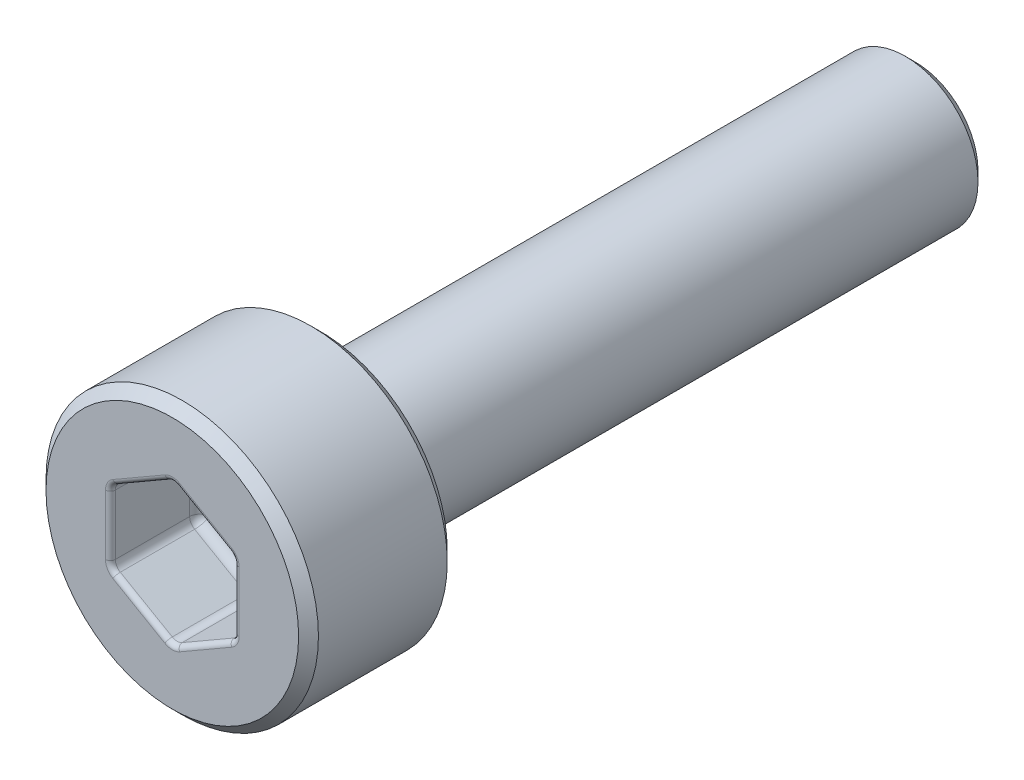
ISO-10303-21;
HEADER;
FILE_DESCRIPTION(('STEP AP214'),'2;1');
FILE_NAME('part.step','',(''),(''),'','','');
FILE_SCHEMA(('AUTOMOTIVE_DESIGN { 1 0 10303 214 1 1 1 1 }'));
ENDSEC;
DATA;
#1=APPLICATION_CONTEXT('core data for automotive mechanical design processes');
#2=APPLICATION_PROTOCOL_DEFINITION('international standard','automotive_design',2000,#1);
#3=PRODUCT_CONTEXT('',#1,'mechanical');
#4=PRODUCT('Part','Part','',(#3));
#5=PRODUCT_RELATED_PRODUCT_CATEGORY('part','',(#4));
#6=PRODUCT_DEFINITION_FORMATION('','',#4);
#7=PRODUCT_DEFINITION_CONTEXT('part definition',#1,'design');
#8=PRODUCT_DEFINITION('design','',#6,#7);
#9=PRODUCT_DEFINITION_SHAPE('','',#8);
#10=(LENGTH_UNIT() NAMED_UNIT(*) SI_UNIT(.MILLI.,.METRE.));
#11=(NAMED_UNIT(*) PLANE_ANGLE_UNIT() SI_UNIT($,.RADIAN.));
#12=(NAMED_UNIT(*) SI_UNIT($,.STERADIAN.) SOLID_ANGLE_UNIT());
#13=UNCERTAINTY_MEASURE_WITH_UNIT(LENGTH_MEASURE(1.E-05),#10,'distance_accuracy_value','');
#14=(GEOMETRIC_REPRESENTATION_CONTEXT(3) GLOBAL_UNCERTAINTY_ASSIGNED_CONTEXT((#13)) GLOBAL_UNIT_ASSIGNED_CONTEXT((#10,
#11,#12)) REPRESENTATION_CONTEXT('',''));
#15=CARTESIAN_POINT('',(0.,0.,0.));
#16=DIRECTION('',(0.,0.,1.));
#17=DIRECTION('',(1.,0.,0.));
#18=AXIS2_PLACEMENT_3D('',#15,#16,#17);
#19=CARTESIAN_POINT('',(0.,0.,3.));
#20=DIRECTION('',(0.,0.,-1.));
#21=DIRECTION('',(-1.,0.,0.));
#22=AXIS2_PLACEMENT_3D('',#19,#20,#21);
#23=PLANE('',#22);
#24=DIRECTION('',(0.,1.,0.));
#25=VECTOR('',#24,1.);
#26=CARTESIAN_POINT('',(1.35,0.,3.));
#27=LINE('',#26,#25);
#28=CARTESIAN_POINT('',(1.35,0.606217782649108,3.));
#29=VERTEX_POINT('',#28);
#30=CARTESIAN_POINT('',(1.35,-0.606217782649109,3.));
#31=VERTEX_POINT('',#30);
#32=EDGE_CURVE('E266',#29,#31,#27,.F.);
#33=ORIENTED_EDGE('',*,*,#32,.T.);
#34=CARTESIAN_POINT('',(1.05,-0.606217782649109,3.));
#35=DIRECTION('',(0.,0.,-1.));
#36=DIRECTION('',(-1.,0.,0.));
#37=AXIS2_PLACEMENT_3D('',#34,#35,#36);
#38=CIRCLE('',#37,0.3);
#39=CARTESIAN_POINT('',(1.2,-0.866025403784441,3.));
#40=VERTEX_POINT('',#39);
#41=EDGE_CURVE('E331',#31,#40,#38,.T.);
#42=ORIENTED_EDGE('',*,*,#41,.T.);
#43=DIRECTION('',(0.866025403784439,0.499999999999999,0.));
#44=VECTOR('',#43,1.);
#45=CARTESIAN_POINT('',(0.675,-1.16913429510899,3.));
#46=LINE('',#45,#44);
#47=CARTESIAN_POINT('',(0.15,-1.47224318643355,3.));
#48=VERTEX_POINT('',#47);
#49=EDGE_CURVE('E329',#40,#48,#46,.F.);
#50=ORIENTED_EDGE('',*,*,#49,.T.);
#51=CARTESIAN_POINT('',(0.,-1.21243556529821,3.));
#52=DIRECTION('',(0.,0.,-1.));
#53=DIRECTION('',(-1.,0.,0.));
#54=AXIS2_PLACEMENT_3D('',#51,#52,#53);
#55=CIRCLE('',#54,0.3);
#56=CARTESIAN_POINT('',(-0.15,-1.47224318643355,3.));
#57=VERTEX_POINT('',#56);
#58=EDGE_CURVE('E327',#48,#57,#55,.T.);
#59=ORIENTED_EDGE('',*,*,#58,.T.);
#60=DIRECTION('',(0.866025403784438,-0.500000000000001,0.));
#61=VECTOR('',#60,1.);
#62=CARTESIAN_POINT('',(-0.675000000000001,-1.16913429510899,3.));
#63=LINE('',#62,#61);
#64=CARTESIAN_POINT('',(-1.2,-0.866025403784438,3.));
#65=VERTEX_POINT('',#64);
#66=EDGE_CURVE('E325',#57,#65,#63,.F.);
#67=ORIENTED_EDGE('',*,*,#66,.T.);
#68=CARTESIAN_POINT('',(-1.05,-0.606217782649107,3.));
#69=DIRECTION('',(0.,0.,-1.));
#70=DIRECTION('',(-1.,0.,0.));
#71=AXIS2_PLACEMENT_3D('',#68,#69,#70);
#72=CIRCLE('',#71,0.3);
#73=CARTESIAN_POINT('',(-1.35,-0.606217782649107,3.));
#74=VERTEX_POINT('',#73);
#75=EDGE_CURVE('E323',#65,#74,#72,.T.);
#76=ORIENTED_EDGE('',*,*,#75,.T.);
#77=DIRECTION('',(0.,-1.,0.));
#78=VECTOR('',#77,1.);
#79=CARTESIAN_POINT('',(-1.35,0.,3.));
#80=LINE('',#79,#78);
#81=CARTESIAN_POINT('',(-1.35,0.606217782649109,3.));
#82=VERTEX_POINT('',#81);
#83=EDGE_CURVE('E321',#74,#82,#80,.F.);
#84=ORIENTED_EDGE('',*,*,#83,.T.);
#85=CARTESIAN_POINT('',(-1.05,0.606217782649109,3.));
#86=DIRECTION('',(0.,0.,-1.));
#87=DIRECTION('',(-1.,0.,0.));
#88=AXIS2_PLACEMENT_3D('',#85,#86,#87);
#89=CIRCLE('',#88,0.3);
#90=CARTESIAN_POINT('',(-1.2,0.86602540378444,3.));
#91=VERTEX_POINT('',#90);
#92=EDGE_CURVE('E319',#82,#91,#89,.T.);
#93=ORIENTED_EDGE('',*,*,#92,.T.);
#94=DIRECTION('',(-0.866025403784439,-0.5,0.));
#95=VECTOR('',#94,1.);
#96=CARTESIAN_POINT('',(-0.675,1.16913429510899,3.));
#97=LINE('',#96,#95);
#98=CARTESIAN_POINT('',(-0.149999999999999,1.47224318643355,3.));
#99=VERTEX_POINT('',#98);
#100=EDGE_CURVE('E317',#91,#99,#97,.F.);
#101=ORIENTED_EDGE('',*,*,#100,.T.);
#102=CARTESIAN_POINT('',(0.,1.21243556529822,3.));
#103=DIRECTION('',(0.,0.,-1.));
#104=DIRECTION('',(-1.,0.,0.));
#105=AXIS2_PLACEMENT_3D('',#102,#103,#104);
#106=CIRCLE('',#105,0.3);
#107=CARTESIAN_POINT('',(0.150000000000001,1.47224318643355,3.));
#108=VERTEX_POINT('',#107);
#109=EDGE_CURVE('E315',#99,#108,#106,.T.);
#110=ORIENTED_EDGE('',*,*,#109,.T.);
#111=DIRECTION('',(-0.866025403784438,0.5,0.));
#112=VECTOR('',#111,1.);
#113=CARTESIAN_POINT('',(0.675000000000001,1.16913429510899,3.));
#114=LINE('',#113,#112);
#115=CARTESIAN_POINT('',(1.2,0.86602540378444,3.));
#116=VERTEX_POINT('',#115);
#117=EDGE_CURVE('E313',#108,#116,#114,.F.);
#118=ORIENTED_EDGE('',*,*,#117,.T.);
#119=CARTESIAN_POINT('',(1.05,0.606217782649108,3.));
#120=DIRECTION('',(0.,0.,-1.));
#121=DIRECTION('',(-1.,0.,0.));
#122=AXIS2_PLACEMENT_3D('',#119,#120,#121);
#123=CIRCLE('',#122,0.3);
#124=EDGE_CURVE('E311',#116,#29,#123,.T.);
#125=ORIENTED_EDGE('',*,*,#124,.T.);
#126=EDGE_LOOP('',(#33,#42,#50,#59,#67,#76,#84,#93,#101,#110,#118,#125));
#127=FACE_BOUND('',#126,.T.);
#128=CARTESIAN_POINT('',(0.,0.,3.));
#129=DIRECTION('',(0.,0.,-1.));
#130=DIRECTION('',(-1.,0.,0.));
#131=AXIS2_PLACEMENT_3D('',#128,#129,#130);
#132=CIRCLE('',#131,2.55);
#133=CARTESIAN_POINT('',(-2.55,0.,3.));
#134=VERTEX_POINT('',#133);
#135=EDGE_CURVE('E309',#134,#134,#132,.F.);
#136=ORIENTED_EDGE('',*,*,#135,.T.);
#137=EDGE_LOOP('',(#136));
#138=FACE_BOUND('',#137,.T.);
#139=ADVANCED_FACE('F37',(#127,#138),#23,.F.);
#140=CARTESIAN_POINT('',(0.,0.,21.9198795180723));
#141=DIRECTION('',(0.,0.,1.));
#142=DIRECTION('',(1.,0.,0.));
#143=AXIS2_PLACEMENT_3D('',#140,#141,#142);
#144=CYLINDRICAL_SURFACE('',#143,2.75);
#145=CARTESIAN_POINT('',(0.,0.,2.79999999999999));
#146=DIRECTION('',(0.,0.,-1.));
#147=DIRECTION('',(-1.,0.,0.));
#148=AXIS2_PLACEMENT_3D('',#145,#146,#147);
#149=CIRCLE('',#148,2.75);
#150=CARTESIAN_POINT('',(-2.75,0.,2.79999999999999));
#151=VERTEX_POINT('',#150);
#152=EDGE_CURVE('E871',#151,#151,#149,.T.);
#153=ORIENTED_EDGE('',*,*,#152,.T.);
#154=EDGE_LOOP('',(#153));
#155=FACE_BOUND('',#154,.T.);
#156=CARTESIAN_POINT('',(0.,0.,0.200000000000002));
#157=DIRECTION('',(0.,0.,1.));
#158=DIRECTION('',(1.,0.,0.));
#159=AXIS2_PLACEMENT_3D('',#156,#157,#158);
#160=CIRCLE('',#159,2.75);
#161=CARTESIAN_POINT('',(2.75,0.,0.200000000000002));
#162=VERTEX_POINT('',#161);
#163=EDGE_CURVE('E876',#162,#162,#160,.T.);
#164=ORIENTED_EDGE('',*,*,#163,.T.);
#165=EDGE_LOOP('',(#164));
#166=FACE_BOUND('',#165,.T.);
#167=ADVANCED_FACE('F430',(#155,#166),#144,.T.);
#168=CARTESIAN_POINT('',(0.,2.75,0.));
#169=DIRECTION('',(0.,0.,1.));
#170=DIRECTION('',(1.,0.,0.));
#171=AXIS2_PLACEMENT_3D('',#168,#169,#170);
#172=PLANE('',#171);
#173=CARTESIAN_POINT('',(0.,0.,0.));
#174=DIRECTION('',(0.,0.,1.));
#175=DIRECTION('',(1.,0.,0.));
#176=AXIS2_PLACEMENT_3D('',#173,#174,#175);
#177=CIRCLE('',#176,1.665);
#178=CARTESIAN_POINT('',(1.665,0.,0.));
#179=VERTEX_POINT('',#178);
#180=EDGE_CURVE('E261',#179,#179,#177,.T.);
#181=ORIENTED_EDGE('',*,*,#180,.T.);
#182=EDGE_LOOP('',(#181));
#183=FACE_BOUND('',#182,.T.);
#184=CARTESIAN_POINT('',(0.,0.,0.));
#185=DIRECTION('',(0.,0.,1.));
#186=DIRECTION('',(1.,0.,0.));
#187=AXIS2_PLACEMENT_3D('',#184,#185,#186);
#188=CIRCLE('',#187,2.54999999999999);
#189=CARTESIAN_POINT('',(2.54999999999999,0.,0.));
#190=VERTEX_POINT('',#189);
#191=EDGE_CURVE('E869',#190,#190,#188,.F.);
#192=ORIENTED_EDGE('',*,*,#191,.T.);
#193=EDGE_LOOP('',(#192));
#194=FACE_BOUND('',#193,.T.);
#195=ADVANCED_FACE('F436',(#183,#194),#172,.F.);
#196=CARTESIAN_POINT('',(0.,0.,21.9198795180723));
#197=DIRECTION('',(0.,0.,1.));
#198=DIRECTION('',(1.,0.,0.));
#199=AXIS2_PLACEMENT_3D('',#196,#197,#198);
#200=CYLINDRICAL_SURFACE('',#199,1.465);
#201=CARTESIAN_POINT('',(0.,0.,-0.200000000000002));
#202=DIRECTION('',(0.,0.,1.));
#203=DIRECTION('',(1.,0.,0.));
#204=AXIS2_PLACEMENT_3D('',#201,#202,#203);
#205=CIRCLE('',#204,1.465);
#206=CARTESIAN_POINT('',(1.465,0.,-0.200000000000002));
#207=VERTEX_POINT('',#206);
#208=EDGE_CURVE('E264',#207,#207,#205,.F.);
#209=ORIENTED_EDGE('',*,*,#208,.T.);
#210=EDGE_LOOP('',(#209));
#211=FACE_BOUND('',#210,.T.);
#212=CARTESIAN_POINT('',(0.,0.,-11.8));
#213=DIRECTION('',(0.,0.,1.));
#214=DIRECTION('',(1.,0.,0.));
#215=AXIS2_PLACEMENT_3D('',#212,#213,#214);
#216=CIRCLE('',#215,1.465);
#217=CARTESIAN_POINT('',(1.465,0.,-11.8));
#218=VERTEX_POINT('',#217);
#219=EDGE_CURVE('E870',#218,#218,#216,.T.);
#220=ORIENTED_EDGE('',*,*,#219,.T.);
#221=EDGE_LOOP('',(#220));
#222=FACE_BOUND('',#221,.T.);
#223=ADVANCED_FACE('F811',(#211,#222),#200,.T.);
#224=CARTESIAN_POINT('',(0.,1.465,-12.));
#225=DIRECTION('',(0.,0.,1.));
#226=DIRECTION('',(1.,0.,0.));
#227=AXIS2_PLACEMENT_3D('',#224,#225,#226);
#228=PLANE('',#227);
#229=CARTESIAN_POINT('',(0.,0.,-12.));
#230=DIRECTION('',(0.,0.,1.));
#231=DIRECTION('',(1.,0.,0.));
#232=AXIS2_PLACEMENT_3D('',#229,#230,#231);
#233=CIRCLE('',#232,1.265);
#234=CARTESIAN_POINT('',(1.265,0.,-12.));
#235=VERTEX_POINT('',#234);
#236=EDGE_CURVE('E211',#235,#235,#233,.F.);
#237=ORIENTED_EDGE('',*,*,#236,.T.);
#238=EDGE_LOOP('',(#237));
#239=FACE_BOUND('',#238,.T.);
#240=ADVANCED_FACE('F803',(#239),#228,.F.);
#241=CARTESIAN_POINT('',(0.,-1.44337567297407,1.2));
#242=DIRECTION('',(0.499999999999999,-0.866025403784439,0.));
#243=DIRECTION('',(0.866025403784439,0.499999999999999,0.));
#244=AXIS2_PLACEMENT_3D('',#241,#242,#243);
#245=PLANE('',#244);
#246=DIRECTION('',(0.,0.,1.));
#247=VECTOR('',#246,1.);
#248=CARTESIAN_POINT('',(0.0999999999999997,-1.3856406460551,3.));
#249=LINE('',#248,#247);
#250=CARTESIAN_POINT('',(0.0999999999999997,-1.3856406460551,1.4));
#251=VERTEX_POINT('',#250);
#252=CARTESIAN_POINT('',(0.0999999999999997,-1.3856406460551,2.9));
#253=VERTEX_POINT('',#252);
#254=EDGE_CURVE('E258',#251,#253,#249,.T.);
#255=ORIENTED_EDGE('',*,*,#254,.T.);
#256=DIRECTION('',(0.866025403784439,0.499999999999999,0.));
#257=VECTOR('',#256,1.);
#258=CARTESIAN_POINT('',(0.,-1.44337567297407,2.9));
#259=LINE('',#258,#257);
#260=CARTESIAN_POINT('',(1.15,-0.779422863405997,2.9));
#261=VERTEX_POINT('',#260);
#262=EDGE_CURVE('E337',#253,#261,#259,.T.);
#263=ORIENTED_EDGE('',*,*,#262,.T.);
#264=DIRECTION('',(0.,0.,1.));
#265=VECTOR('',#264,1.);
#266=CARTESIAN_POINT('',(1.15,-0.779422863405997,1.2));
#267=LINE('',#266,#265);
#268=CARTESIAN_POINT('',(1.15,-0.779422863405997,1.4));
#269=VERTEX_POINT('',#268);
#270=EDGE_CURVE('E254',#261,#269,#267,.F.);
#271=ORIENTED_EDGE('',*,*,#270,.T.);
#272=DIRECTION('',(0.866025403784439,0.499999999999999,0.));
#273=VECTOR('',#272,1.);
#274=CARTESIAN_POINT('',(0.,-1.44337567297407,1.4));
#275=LINE('',#274,#273);
#276=EDGE_CURVE('E256',#269,#251,#275,.F.);
#277=ORIENTED_EDGE('',*,*,#276,.T.);
#278=EDGE_LOOP('',(#255,#263,#271,#277));
#279=FACE_BOUND('',#278,.T.);
#280=ADVANCED_FACE('F794',(#279),#245,.F.);
#281=CARTESIAN_POINT('',(-1.25,-0.721687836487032,1.2));
#282=DIRECTION('',(-0.5,-0.866025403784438,0.));
#283=DIRECTION('',(0.866025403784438,-0.500000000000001,0.));
#284=AXIS2_PLACEMENT_3D('',#281,#282,#283);
#285=PLANE('',#284);
#286=DIRECTION('',(0.,0.,1.));
#287=VECTOR('',#286,1.);
#288=CARTESIAN_POINT('',(-1.15,-0.779422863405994,3.));
#289=LINE('',#288,#287);
#290=CARTESIAN_POINT('',(-1.15,-0.779422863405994,1.4));
#291=VERTEX_POINT('',#290);
#292=CARTESIAN_POINT('',(-1.15,-0.779422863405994,2.9));
#293=VERTEX_POINT('',#292);
#294=EDGE_CURVE('E225',#291,#293,#289,.T.);
#295=ORIENTED_EDGE('',*,*,#294,.T.);
#296=DIRECTION('',(0.866025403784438,-0.500000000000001,0.));
#297=VECTOR('',#296,1.);
#298=CARTESIAN_POINT('',(-1.25,-0.721687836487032,2.9));
#299=LINE('',#298,#297);
#300=CARTESIAN_POINT('',(-0.1,-1.3856406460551,2.9));
#301=VERTEX_POINT('',#300);
#302=EDGE_CURVE('E341',#293,#301,#299,.T.);
#303=ORIENTED_EDGE('',*,*,#302,.T.);
#304=DIRECTION('',(0.,0.,1.));
#305=VECTOR('',#304,1.);
#306=CARTESIAN_POINT('',(-0.1,-1.3856406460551,1.2));
#307=LINE('',#306,#305);
#308=CARTESIAN_POINT('',(-0.1,-1.3856406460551,1.4));
#309=VERTEX_POINT('',#308);
#310=EDGE_CURVE('E217',#301,#309,#307,.F.);
#311=ORIENTED_EDGE('',*,*,#310,.T.);
#312=DIRECTION('',(0.866025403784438,-0.500000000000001,0.));
#313=VECTOR('',#312,1.);
#314=CARTESIAN_POINT('',(-1.25,-0.721687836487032,1.4));
#315=LINE('',#314,#313);
#316=EDGE_CURVE('E188',#309,#291,#315,.F.);
#317=ORIENTED_EDGE('',*,*,#316,.T.);
#318=EDGE_LOOP('',(#295,#303,#311,#317));
#319=FACE_BOUND('',#318,.T.);
#320=ADVANCED_FACE('F786',(#319),#285,.F.);
#321=CARTESIAN_POINT('',(-1.25,0.721687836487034,1.2));
#322=DIRECTION('',(-1.,0.,0.));
#323=DIRECTION('',(0.,-1.,0.));
#324=AXIS2_PLACEMENT_3D('',#321,#322,#323);
#325=PLANE('',#324);
#326=DIRECTION('',(0.,0.,1.));
#327=VECTOR('',#326,1.);
#328=CARTESIAN_POINT('',(-1.25,0.606217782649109,3.));
#329=LINE('',#328,#327);
#330=CARTESIAN_POINT('',(-1.25,0.606217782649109,1.4));
#331=VERTEX_POINT('',#330);
#332=CARTESIAN_POINT('',(-1.25,0.606217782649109,2.9));
#333=VERTEX_POINT('',#332);
#334=EDGE_CURVE('E228',#331,#333,#329,.T.);
#335=ORIENTED_EDGE('',*,*,#334,.T.);
#336=DIRECTION('',(0.,-1.,0.));
#337=VECTOR('',#336,1.);
#338=CARTESIAN_POINT('',(-1.25,0.721687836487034,2.9));
#339=LINE('',#338,#337);
#340=CARTESIAN_POINT('',(-1.25,-0.606217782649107,2.9));
#341=VERTEX_POINT('',#340);
#342=EDGE_CURVE('E345',#333,#341,#339,.T.);
#343=ORIENTED_EDGE('',*,*,#342,.T.);
#344=DIRECTION('',(0.,0.,1.));
#345=VECTOR('',#344,1.);
#346=CARTESIAN_POINT('',(-1.25,-0.606217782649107,1.2));
#347=LINE('',#346,#345);
#348=CARTESIAN_POINT('',(-1.25,-0.606217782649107,1.4));
#349=VERTEX_POINT('',#348);
#350=EDGE_CURVE('E233',#341,#349,#347,.F.);
#351=ORIENTED_EDGE('',*,*,#350,.T.);
#352=DIRECTION('',(0.,-1.,0.));
#353=VECTOR('',#352,1.);
#354=CARTESIAN_POINT('',(-1.25,0.721687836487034,1.4));
#355=LINE('',#354,#353);
#356=EDGE_CURVE('E231',#349,#331,#355,.F.);
#357=ORIENTED_EDGE('',*,*,#356,.T.);
#358=EDGE_LOOP('',(#335,#343,#351,#357));
#359=FACE_BOUND('',#358,.T.);
#360=ADVANCED_FACE('F405',(#359),#325,.F.);
#361=CARTESIAN_POINT('',(0.,1.44337567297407,1.2));
#362=DIRECTION('',(-0.5,0.866025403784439,0.));
#363=DIRECTION('',(-0.866025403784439,-0.5,0.));
#364=AXIS2_PLACEMENT_3D('',#361,#362,#363);
#365=PLANE('',#364);
#366=DIRECTION('',(0.,0.,1.));
#367=VECTOR('',#366,1.);
#368=CARTESIAN_POINT('',(-0.0999999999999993,1.3856406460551,3.));
#369=LINE('',#368,#367);
#370=CARTESIAN_POINT('',(-0.0999999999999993,1.3856406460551,1.4));
#371=VERTEX_POINT('',#370);
#372=CARTESIAN_POINT('',(-0.0999999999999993,1.3856406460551,2.9));
#373=VERTEX_POINT('',#372);
#374=EDGE_CURVE('E239',#371,#373,#369,.T.);
#375=ORIENTED_EDGE('',*,*,#374,.T.);
#376=DIRECTION('',(-0.866025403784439,-0.5,0.));
#377=VECTOR('',#376,1.);
#378=CARTESIAN_POINT('',(0.,1.44337567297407,2.9));
#379=LINE('',#378,#377);
#380=CARTESIAN_POINT('',(-1.15,0.779422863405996,2.9));
#381=VERTEX_POINT('',#380);
#382=EDGE_CURVE('E349',#373,#381,#379,.T.);
#383=ORIENTED_EDGE('',*,*,#382,.T.);
#384=DIRECTION('',(0.,0.,1.));
#385=VECTOR('',#384,1.);
#386=CARTESIAN_POINT('',(-1.15,0.779422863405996,1.2));
#387=LINE('',#386,#385);
#388=CARTESIAN_POINT('',(-1.15,0.779422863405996,1.4));
#389=VERTEX_POINT('',#388);
#390=EDGE_CURVE('E235',#381,#389,#387,.F.);
#391=ORIENTED_EDGE('',*,*,#390,.T.);
#392=DIRECTION('',(-0.866025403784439,-0.5,0.));
#393=VECTOR('',#392,1.);
#394=CARTESIAN_POINT('',(0.,1.44337567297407,1.4));
#395=LINE('',#394,#393);
#396=EDGE_CURVE('E237',#389,#371,#395,.F.);
#397=ORIENTED_EDGE('',*,*,#396,.T.);
#398=EDGE_LOOP('',(#375,#383,#391,#397));
#399=FACE_BOUND('',#398,.T.);
#400=ADVANCED_FACE('F769',(#399),#365,.F.);
#401=CARTESIAN_POINT('',(1.25,0.721687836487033,1.2));
#402=DIRECTION('',(0.5,0.866025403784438,0.));
#403=DIRECTION('',(-0.866025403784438,0.5,0.));
#404=AXIS2_PLACEMENT_3D('',#401,#402,#403);
#405=PLANE('',#404);
#406=DIRECTION('',(0.,0.,1.));
#407=VECTOR('',#406,1.);
#408=CARTESIAN_POINT('',(1.15,0.779422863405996,3.));
#409=LINE('',#408,#407);
#410=CARTESIAN_POINT('',(1.15,0.779422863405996,1.4));
#411=VERTEX_POINT('',#410);
#412=CARTESIAN_POINT('',(1.15,0.779422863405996,2.9));
#413=VERTEX_POINT('',#412);
#414=EDGE_CURVE('E246',#411,#413,#409,.T.);
#415=ORIENTED_EDGE('',*,*,#414,.T.);
#416=DIRECTION('',(-0.866025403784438,0.5,0.));
#417=VECTOR('',#416,1.);
#418=CARTESIAN_POINT('',(1.25,0.721687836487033,2.9));
#419=LINE('',#418,#417);
#420=CARTESIAN_POINT('',(0.100000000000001,1.3856406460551,2.9));
#421=VERTEX_POINT('',#420);
#422=EDGE_CURVE('E353',#413,#421,#419,.T.);
#423=ORIENTED_EDGE('',*,*,#422,.T.);
#424=DIRECTION('',(0.,0.,1.));
#425=VECTOR('',#424,1.);
#426=CARTESIAN_POINT('',(0.100000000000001,1.3856406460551,1.2));
#427=LINE('',#426,#425);
#428=CARTESIAN_POINT('',(0.100000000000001,1.3856406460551,1.4));
#429=VERTEX_POINT('',#428);
#430=EDGE_CURVE('E242',#421,#429,#427,.F.);
#431=ORIENTED_EDGE('',*,*,#430,.T.);
#432=DIRECTION('',(-0.866025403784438,0.5,0.));
#433=VECTOR('',#432,1.);
#434=CARTESIAN_POINT('',(1.25,0.721687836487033,1.4));
#435=LINE('',#434,#433);
#436=EDGE_CURVE('E244',#429,#411,#435,.F.);
#437=ORIENTED_EDGE('',*,*,#436,.T.);
#438=EDGE_LOOP('',(#415,#423,#431,#437));
#439=FACE_BOUND('',#438,.T.);
#440=ADVANCED_FACE('F761',(#439),#405,.F.);
#441=CARTESIAN_POINT('',(1.25,-0.721687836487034,1.2));
#442=DIRECTION('',(1.,0.,0.));
#443=DIRECTION('',(0.,1.,0.));
#444=AXIS2_PLACEMENT_3D('',#441,#442,#443);
#445=PLANE('',#444);
#446=DIRECTION('',(0.,0.,1.));
#447=VECTOR('',#446,1.);
#448=CARTESIAN_POINT('',(1.25,-0.606217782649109,3.));
#449=LINE('',#448,#447);
#450=CARTESIAN_POINT('',(1.25,-0.606217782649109,1.4));
#451=VERTEX_POINT('',#450);
#452=CARTESIAN_POINT('',(1.25,-0.606217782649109,2.9));
#453=VERTEX_POINT('',#452);
#454=EDGE_CURVE('E252',#451,#453,#449,.T.);
#455=ORIENTED_EDGE('',*,*,#454,.T.);
#456=DIRECTION('',(0.,1.,0.));
#457=VECTOR('',#456,1.);
#458=CARTESIAN_POINT('',(1.25,-0.721687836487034,2.9));
#459=LINE('',#458,#457);
#460=CARTESIAN_POINT('',(1.25,0.606217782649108,2.9));
#461=VERTEX_POINT('',#460);
#462=EDGE_CURVE('E11',#453,#461,#459,.T.);
#463=ORIENTED_EDGE('',*,*,#462,.T.);
#464=DIRECTION('',(0.,0.,1.));
#465=VECTOR('',#464,1.);
#466=CARTESIAN_POINT('',(1.25,0.606217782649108,1.2));
#467=LINE('',#466,#465);
#468=CARTESIAN_POINT('',(1.25,0.606217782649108,1.4));
#469=VERTEX_POINT('',#468);
#470=EDGE_CURVE('E248',#461,#469,#467,.F.);
#471=ORIENTED_EDGE('',*,*,#470,.T.);
#472=DIRECTION('',(0.,1.,0.));
#473=VECTOR('',#472,1.);
#474=CARTESIAN_POINT('',(1.25,-0.721687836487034,1.4));
#475=LINE('',#474,#473);
#476=EDGE_CURVE('E250',#469,#451,#475,.F.);
#477=ORIENTED_EDGE('',*,*,#476,.T.);
#478=EDGE_LOOP('',(#455,#463,#471,#477));
#479=FACE_BOUND('',#478,.T.);
#480=ADVANCED_FACE('F753',(#479),#445,.F.);
#481=CARTESIAN_POINT('',(0.,0.,1.2));
#482=DIRECTION('',(0.,0.,1.));
#483=DIRECTION('',(1.,0.,0.));
#484=AXIS2_PLACEMENT_3D('',#481,#482,#483);
#485=PLANE('',#484);
#486=DIRECTION('',(0.,-1.,0.));
#487=VECTOR('',#486,1.);
#488=CARTESIAN_POINT('',(-1.05,0.,1.2));
#489=LINE('',#488,#487);
#490=CARTESIAN_POINT('',(-1.05,0.606217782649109,1.2));
#491=VERTEX_POINT('',#490);
#492=CARTESIAN_POINT('',(-1.05,-0.606217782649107,1.2));
#493=VERTEX_POINT('',#492);
#494=EDGE_CURVE('E215',#491,#493,#489,.T.);
#495=ORIENTED_EDGE('',*,*,#494,.T.);
#496=DIRECTION('',(0.866025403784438,-0.500000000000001,0.));
#497=VECTOR('',#496,1.);
#498=CARTESIAN_POINT('',(-0.525000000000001,-0.909326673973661,1.2));
#499=LINE('',#498,#497);
#500=CARTESIAN_POINT('',(0.,-1.21243556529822,1.2));
#501=VERTEX_POINT('',#500);
#502=EDGE_CURVE('E186',#493,#501,#499,.T.);
#503=ORIENTED_EDGE('',*,*,#502,.T.);
#504=DIRECTION('',(0.866025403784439,0.499999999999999,0.));
#505=VECTOR('',#504,1.);
#506=CARTESIAN_POINT('',(0.525,-0.909326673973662,1.2));
#507=LINE('',#506,#505);
#508=CARTESIAN_POINT('',(1.05,-0.606217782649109,1.2));
#509=VERTEX_POINT('',#508);
#510=EDGE_CURVE('E204',#501,#509,#507,.T.);
#511=ORIENTED_EDGE('',*,*,#510,.T.);
#512=DIRECTION('',(0.,1.,0.));
#513=VECTOR('',#512,1.);
#514=CARTESIAN_POINT('',(1.05,0.,1.2));
#515=LINE('',#514,#513);
#516=CARTESIAN_POINT('',(1.05,0.606217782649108,1.2));
#517=VERTEX_POINT('',#516);
#518=EDGE_CURVE('E210',#509,#517,#515,.T.);
#519=ORIENTED_EDGE('',*,*,#518,.T.);
#520=DIRECTION('',(-0.866025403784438,0.5,0.));
#521=VECTOR('',#520,1.);
#522=CARTESIAN_POINT('',(0.525000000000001,0.909326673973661,1.2));
#523=LINE('',#522,#521);
#524=CARTESIAN_POINT('',(0.,1.21243556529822,1.2));
#525=VERTEX_POINT('',#524);
#526=EDGE_CURVE('E883',#517,#525,#523,.T.);
#527=ORIENTED_EDGE('',*,*,#526,.T.);
#528=DIRECTION('',(-0.866025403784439,-0.5,0.));
#529=VECTOR('',#528,1.);
#530=CARTESIAN_POINT('',(-0.525,0.909326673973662,1.2));
#531=LINE('',#530,#529);
#532=EDGE_CURVE('E220',#525,#491,#531,.T.);
#533=ORIENTED_EDGE('',*,*,#532,.T.);
#534=EDGE_LOOP('',(#495,#503,#511,#519,#527,#533));
#535=FACE_BOUND('',#534,.T.);
#536=ADVANCED_FACE('F213',(#535),#485,.T.);
#537=CARTESIAN_POINT('',(0.,0.,3.));
#538=DIRECTION('',(0.,0.,-1.));
#539=DIRECTION('',(-1.,0.,0.));
#540=AXIS2_PLACEMENT_3D('',#537,#538,#539);
#541=CONICAL_SURFACE('',#540,2.54999999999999,0.785398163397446);
#542=ORIENTED_EDGE('',*,*,#152,.F.);
#543=EDGE_LOOP('',(#542));
#544=FACE_BOUND('',#543,.T.);
#545=ORIENTED_EDGE('',*,*,#135,.F.);
#546=EDGE_LOOP('',(#545));
#547=FACE_BOUND('',#546,.T.);
#548=ADVANCED_FACE('F442',(#544,#547),#541,.T.);
#549=CARTESIAN_POINT('',(0.,0.,0.200000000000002));
#550=DIRECTION('',(0.,0.,1.));
#551=DIRECTION('',(1.,0.,0.));
#552=AXIS2_PLACEMENT_3D('',#549,#550,#551);
#553=CONICAL_SURFACE('',#552,2.75,0.785398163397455);
#554=ORIENTED_EDGE('',*,*,#191,.F.);
#555=EDGE_LOOP('',(#554));
#556=FACE_BOUND('',#555,.T.);
#557=ORIENTED_EDGE('',*,*,#163,.F.);
#558=EDGE_LOOP('',(#557));
#559=FACE_BOUND('',#558,.T.);
#560=ADVANCED_FACE('F445',(#556,#559),#553,.T.);
#561=CARTESIAN_POINT('',(0.,0.,-11.8));
#562=DIRECTION('',(0.,0.,1.));
#563=DIRECTION('',(1.,0.,0.));
#564=AXIS2_PLACEMENT_3D('',#561,#562,#563);
#565=CONICAL_SURFACE('',#564,1.465,0.785398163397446);
#566=ORIENTED_EDGE('',*,*,#236,.F.);
#567=EDGE_LOOP('',(#566));
#568=FACE_BOUND('',#567,.T.);
#569=ORIENTED_EDGE('',*,*,#219,.F.);
#570=EDGE_LOOP('',(#569));
#571=FACE_BOUND('',#570,.T.);
#572=ADVANCED_FACE('F449',(#568,#571),#565,.T.);
#573=CARTESIAN_POINT('',(0.,1.21243556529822,1.2));
#574=DIRECTION('',(0.,0.,-1.));
#575=DIRECTION('',(-1.,0.,0.));
#576=AXIS2_PLACEMENT_3D('',#573,#574,#575);
#577=CYLINDRICAL_SURFACE('',#576,0.2);
#578=ORIENTED_EDGE('',*,*,#430,.F.);
#579=CARTESIAN_POINT('',(0.,1.21243556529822,2.9));
#580=DIRECTION('',(0.,0.,-1.));
#581=DIRECTION('',(-1.,0.,0.));
#582=AXIS2_PLACEMENT_3D('',#579,#580,#581);
#583=CIRCLE('',#582,0.2);
#584=EDGE_CURVE('E351',#421,#373,#583,.F.);
#585=ORIENTED_EDGE('',*,*,#584,.T.);
#586=ORIENTED_EDGE('',*,*,#374,.F.);
#587=CARTESIAN_POINT('',(0.,1.21243556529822,1.4));
#588=DIRECTION('',(0.,0.,1.));
#589=DIRECTION('',(1.,0.,0.));
#590=AXIS2_PLACEMENT_3D('',#587,#588,#589);
#591=CIRCLE('',#590,0.2);
#592=EDGE_CURVE('E306',#429,#371,#591,.T.);
#593=ORIENTED_EDGE('',*,*,#592,.F.);
#594=EDGE_LOOP('',(#578,#585,#586,#593));
#595=FACE_BOUND('',#594,.T.);
#596=ADVANCED_FACE('F453',(#595),#577,.F.);
#597=CARTESIAN_POINT('',(0.525000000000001,0.909326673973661,1.4));
#598=DIRECTION('',(-0.866025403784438,0.5,0.));
#599=DIRECTION('',(-0.5,-0.866025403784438,0.));
#600=AXIS2_PLACEMENT_3D('',#597,#598,#599);
#601=CYLINDRICAL_SURFACE('',#600,0.2);
#602=CARTESIAN_POINT('',(1.05,0.606217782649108,1.4));
#603=DIRECTION('',(-0.866025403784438,0.5,0.));
#604=DIRECTION('',(-0.5,-0.866025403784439,0.));
#605=AXIS2_PLACEMENT_3D('',#602,#603,#604);
#606=CIRCLE('',#605,0.2);
#607=EDGE_CURVE('E300',#411,#517,#606,.T.);
#608=ORIENTED_EDGE('',*,*,#607,.F.);
#609=ORIENTED_EDGE('',*,*,#436,.F.);
#610=CARTESIAN_POINT('',(0.,1.21243556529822,1.4));
#611=DIRECTION('',(0.866025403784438,-0.500000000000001,0.));
#612=DIRECTION('',(0.500000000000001,0.866025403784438,0.));
#613=AXIS2_PLACEMENT_3D('',#610,#611,#612);
#614=CIRCLE('',#613,0.2);
#615=EDGE_CURVE('E303',#525,#429,#614,.T.);
#616=ORIENTED_EDGE('',*,*,#615,.F.);
#617=ORIENTED_EDGE('',*,*,#526,.F.);
#618=EDGE_LOOP('',(#608,#609,#616,#617));
#619=FACE_BOUND('',#618,.T.);
#620=ADVANCED_FACE('F714',(#619),#601,.F.);
#621=CARTESIAN_POINT('',(1.05,0.606217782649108,1.2));
#622=DIRECTION('',(0.,0.,-1.));
#623=DIRECTION('',(-1.,0.,0.));
#624=AXIS2_PLACEMENT_3D('',#621,#622,#623);
#625=CYLINDRICAL_SURFACE('',#624,0.2);
#626=ORIENTED_EDGE('',*,*,#470,.F.);
#627=CARTESIAN_POINT('',(1.05,0.606217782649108,2.9));
#628=DIRECTION('',(0.,0.,-1.));
#629=DIRECTION('',(-1.,0.,0.));
#630=AXIS2_PLACEMENT_3D('',#627,#628,#629);
#631=CIRCLE('',#630,0.2);
#632=EDGE_CURVE('E46',#461,#413,#631,.F.);
#633=ORIENTED_EDGE('',*,*,#632,.T.);
#634=ORIENTED_EDGE('',*,*,#414,.F.);
#635=CARTESIAN_POINT('',(1.05,0.606217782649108,1.4));
#636=DIRECTION('',(0.,0.,1.));
#637=DIRECTION('',(1.,0.,0.));
#638=AXIS2_PLACEMENT_3D('',#635,#636,#637);
#639=CIRCLE('',#638,0.2);
#640=EDGE_CURVE('E297',#469,#411,#639,.T.);
#641=ORIENTED_EDGE('',*,*,#640,.F.);
#642=EDGE_LOOP('',(#626,#633,#634,#641));
#643=FACE_BOUND('',#642,.T.);
#644=ADVANCED_FACE('F705',(#643),#625,.F.);
#645=CARTESIAN_POINT('',(0.,1.21243556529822,1.4));
#646=DIRECTION('',(0.,0.,1.));
#647=DIRECTION('',(1.,0.,0.));
#648=AXIS2_PLACEMENT_3D('',#645,#646,#647);
#649=SPHERICAL_SURFACE('',#648,0.2);
#650=ORIENTED_EDGE('',*,*,#615,.T.);
#651=ORIENTED_EDGE('',*,*,#592,.T.);
#652=CARTESIAN_POINT('',(0.,1.21243556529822,1.4));
#653=DIRECTION('',(-0.866025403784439,-0.5,0.));
#654=DIRECTION('',(0.5,-0.866025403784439,0.));
#655=AXIS2_PLACEMENT_3D('',#652,#653,#654);
#656=CIRCLE('',#655,0.2);
#657=EDGE_CURVE('E294',#525,#371,#656,.F.);
#658=ORIENTED_EDGE('',*,*,#657,.F.);
#659=EDGE_LOOP('',(#650,#651,#658));
#660=FACE_BOUND('',#659,.T.);
#661=ADVANCED_FACE('F696',(#660),#649,.F.);
#662=CARTESIAN_POINT('',(1.05,0.606217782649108,1.4));
#663=DIRECTION('',(0.,0.,1.));
#664=DIRECTION('',(1.,0.,0.));
#665=AXIS2_PLACEMENT_3D('',#662,#663,#664);
#666=SPHERICAL_SURFACE('',#665,0.2);
#667=ORIENTED_EDGE('',*,*,#640,.T.);
#668=ORIENTED_EDGE('',*,*,#607,.T.);
#669=CARTESIAN_POINT('',(1.05,0.606217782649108,1.4));
#670=DIRECTION('',(0.,-1.,0.));
#671=DIRECTION('',(0.,0.,-1.));
#672=AXIS2_PLACEMENT_3D('',#669,#670,#671);
#673=CIRCLE('',#672,0.2);
#674=EDGE_CURVE('E291',#469,#517,#673,.F.);
#675=ORIENTED_EDGE('',*,*,#674,.F.);
#676=EDGE_LOOP('',(#667,#668,#675));
#677=FACE_BOUND('',#676,.T.);
#678=ADVANCED_FACE('F688',(#677),#666,.F.);
#679=CARTESIAN_POINT('',(-1.05,0.606217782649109,1.2));
#680=DIRECTION('',(0.,0.,-1.));
#681=DIRECTION('',(-1.,0.,0.));
#682=AXIS2_PLACEMENT_3D('',#679,#680,#681);
#683=CYLINDRICAL_SURFACE('',#682,0.2);
#684=ORIENTED_EDGE('',*,*,#390,.F.);
#685=CARTESIAN_POINT('',(-1.05,0.606217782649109,2.9));
#686=DIRECTION('',(0.,0.,-1.));
#687=DIRECTION('',(-1.,0.,0.));
#688=AXIS2_PLACEMENT_3D('',#685,#686,#687);
#689=CIRCLE('',#688,0.2);
#690=EDGE_CURVE('E347',#381,#333,#689,.F.);
#691=ORIENTED_EDGE('',*,*,#690,.T.);
#692=ORIENTED_EDGE('',*,*,#334,.F.);
#693=CARTESIAN_POINT('',(-1.05,0.606217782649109,1.4));
#694=DIRECTION('',(0.,0.,1.));
#695=DIRECTION('',(1.,0.,0.));
#696=AXIS2_PLACEMENT_3D('',#693,#694,#695);
#697=CIRCLE('',#696,0.2);
#698=EDGE_CURVE('E288',#389,#331,#697,.T.);
#699=ORIENTED_EDGE('',*,*,#698,.F.);
#700=EDGE_LOOP('',(#684,#691,#692,#699));
#701=FACE_BOUND('',#700,.T.);
#702=ADVANCED_FACE('F402',(#701),#683,.F.);
#703=CARTESIAN_POINT('',(-0.525,0.909326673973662,1.4));
#704=DIRECTION('',(-0.866025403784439,-0.5,0.));
#705=DIRECTION('',(0.5,-0.866025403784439,0.));
#706=AXIS2_PLACEMENT_3D('',#703,#704,#705);
#707=CYLINDRICAL_SURFACE('',#706,0.2);
#708=ORIENTED_EDGE('',*,*,#657,.T.);
#709=ORIENTED_EDGE('',*,*,#396,.F.);
#710=CARTESIAN_POINT('',(-1.05,0.606217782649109,1.4));
#711=DIRECTION('',(0.866025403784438,0.5,0.));
#712=DIRECTION('',(-0.5,0.866025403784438,0.));
#713=AXIS2_PLACEMENT_3D('',#710,#711,#712);
#714=CIRCLE('',#713,0.2);
#715=EDGE_CURVE('E285',#491,#389,#714,.T.);
#716=ORIENTED_EDGE('',*,*,#715,.F.);
#717=ORIENTED_EDGE('',*,*,#532,.F.);
#718=EDGE_LOOP('',(#708,#709,#716,#717));
#719=FACE_BOUND('',#718,.T.);
#720=ADVANCED_FACE('F671',(#719),#707,.F.);
#721=CARTESIAN_POINT('',(1.05,0.,1.4));
#722=DIRECTION('',(0.,1.,0.));
#723=DIRECTION('',(-1.,0.,0.));
#724=AXIS2_PLACEMENT_3D('',#721,#722,#723);
#725=CYLINDRICAL_SURFACE('',#724,0.2);
#726=ORIENTED_EDGE('',*,*,#674,.T.);
#727=ORIENTED_EDGE('',*,*,#518,.F.);
#728=CARTESIAN_POINT('',(1.05,-0.606217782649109,1.4));
#729=DIRECTION('',(0.,1.,0.));
#730=DIRECTION('',(0.,0.,1.));
#731=AXIS2_PLACEMENT_3D('',#728,#729,#730);
#732=CIRCLE('',#731,0.2);
#733=EDGE_CURVE('E282',#451,#509,#732,.T.);
#734=ORIENTED_EDGE('',*,*,#733,.F.);
#735=ORIENTED_EDGE('',*,*,#476,.F.);
#736=EDGE_LOOP('',(#726,#727,#734,#735));
#737=FACE_BOUND('',#736,.T.);
#738=ADVANCED_FACE('F662',(#737),#725,.F.);
#739=CARTESIAN_POINT('',(1.05,-0.606217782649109,1.2));
#740=DIRECTION('',(0.,0.,-1.));
#741=DIRECTION('',(-1.,0.,0.));
#742=AXIS2_PLACEMENT_3D('',#739,#740,#741);
#743=CYLINDRICAL_SURFACE('',#742,0.2);
#744=ORIENTED_EDGE('',*,*,#270,.F.);
#745=CARTESIAN_POINT('',(1.05,-0.606217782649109,2.9));
#746=DIRECTION('',(0.,0.,-1.));
#747=DIRECTION('',(-1.,0.,0.));
#748=AXIS2_PLACEMENT_3D('',#745,#746,#747);
#749=CIRCLE('',#748,0.2);
#750=EDGE_CURVE('E334',#261,#453,#749,.F.);
#751=ORIENTED_EDGE('',*,*,#750,.T.);
#752=ORIENTED_EDGE('',*,*,#454,.F.);
#753=CARTESIAN_POINT('',(1.05,-0.606217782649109,1.4));
#754=DIRECTION('',(0.,0.,1.));
#755=DIRECTION('',(1.,0.,0.));
#756=AXIS2_PLACEMENT_3D('',#753,#754,#755);
#757=CIRCLE('',#756,0.2);
#758=EDGE_CURVE('E279',#269,#451,#757,.T.);
#759=ORIENTED_EDGE('',*,*,#758,.F.);
#760=EDGE_LOOP('',(#744,#751,#752,#759));
#761=FACE_BOUND('',#760,.T.);
#762=ADVANCED_FACE('F653',(#761),#743,.F.);
#763=CARTESIAN_POINT('',(-1.05,0.606217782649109,1.4));
#764=DIRECTION('',(0.,0.,1.));
#765=DIRECTION('',(1.,0.,0.));
#766=AXIS2_PLACEMENT_3D('',#763,#764,#765);
#767=SPHERICAL_SURFACE('',#766,0.2);
#768=ORIENTED_EDGE('',*,*,#715,.T.);
#769=ORIENTED_EDGE('',*,*,#698,.T.);
#770=CARTESIAN_POINT('',(-1.05,0.606217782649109,1.4));
#771=DIRECTION('',(0.,-1.,0.));
#772=DIRECTION('',(0.,0.,-1.));
#773=AXIS2_PLACEMENT_3D('',#770,#771,#772);
#774=CIRCLE('',#773,0.2);
#775=EDGE_CURVE('E276',#491,#331,#774,.F.);
#776=ORIENTED_EDGE('',*,*,#775,.F.);
#777=EDGE_LOOP('',(#768,#769,#776));
#778=FACE_BOUND('',#777,.T.);
#779=ADVANCED_FACE('F644',(#778),#767,.F.);
#780=CARTESIAN_POINT('',(1.05,-0.606217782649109,1.4));
#781=DIRECTION('',(0.,0.,1.));
#782=DIRECTION('',(1.,0.,0.));
#783=AXIS2_PLACEMENT_3D('',#780,#781,#782);
#784=SPHERICAL_SURFACE('',#783,0.2);
#785=ORIENTED_EDGE('',*,*,#758,.T.);
#786=ORIENTED_EDGE('',*,*,#733,.T.);
#787=CARTESIAN_POINT('',(1.05,-0.606217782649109,1.4));
#788=DIRECTION('',(-0.866025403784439,-0.5,0.));
#789=DIRECTION('',(0.5,-0.866025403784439,0.));
#790=AXIS2_PLACEMENT_3D('',#787,#788,#789);
#791=CIRCLE('',#790,0.2);
#792=EDGE_CURVE('E207',#269,#509,#791,.F.);
#793=ORIENTED_EDGE('',*,*,#792,.F.);
#794=EDGE_LOOP('',(#785,#786,#793));
#795=FACE_BOUND('',#794,.T.);
#796=ADVANCED_FACE('F636',(#795),#784,.F.);
#797=CARTESIAN_POINT('',(-1.05,-0.606217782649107,1.2));
#798=DIRECTION('',(0.,0.,-1.));
#799=DIRECTION('',(-1.,0.,0.));
#800=AXIS2_PLACEMENT_3D('',#797,#798,#799);
#801=CYLINDRICAL_SURFACE('',#800,0.2);
#802=ORIENTED_EDGE('',*,*,#350,.F.);
#803=CARTESIAN_POINT('',(-1.05,-0.606217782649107,2.9));
#804=DIRECTION('',(0.,0.,-1.));
#805=DIRECTION('',(-1.,0.,0.));
#806=AXIS2_PLACEMENT_3D('',#803,#804,#805);
#807=CIRCLE('',#806,0.2);
#808=EDGE_CURVE('E343',#341,#293,#807,.F.);
#809=ORIENTED_EDGE('',*,*,#808,.T.);
#810=ORIENTED_EDGE('',*,*,#294,.F.);
#811=CARTESIAN_POINT('',(-1.05,-0.606217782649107,1.4));
#812=DIRECTION('',(0.,0.,1.));
#813=DIRECTION('',(1.,0.,0.));
#814=AXIS2_PLACEMENT_3D('',#811,#812,#813);
#815=CIRCLE('',#814,0.2);
#816=EDGE_CURVE('E272',#349,#291,#815,.T.);
#817=ORIENTED_EDGE('',*,*,#816,.F.);
#818=EDGE_LOOP('',(#802,#809,#810,#817));
#819=FACE_BOUND('',#818,.T.);
#820=ADVANCED_FACE('F415',(#819),#801,.F.);
#821=CARTESIAN_POINT('',(-1.05,0.,1.4));
#822=DIRECTION('',(0.,-1.,0.));
#823=DIRECTION('',(1.,0.,0.));
#824=AXIS2_PLACEMENT_3D('',#821,#822,#823);
#825=CYLINDRICAL_SURFACE('',#824,0.2);
#826=ORIENTED_EDGE('',*,*,#775,.T.);
#827=ORIENTED_EDGE('',*,*,#356,.F.);
#828=CARTESIAN_POINT('',(-1.05,-0.606217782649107,1.4));
#829=DIRECTION('',(0.,1.,0.));
#830=DIRECTION('',(-1.,0.,0.));
#831=AXIS2_PLACEMENT_3D('',#828,#829,#830);
#832=CIRCLE('',#831,0.2);
#833=EDGE_CURVE('E201',#493,#349,#832,.T.);
#834=ORIENTED_EDGE('',*,*,#833,.F.);
#835=ORIENTED_EDGE('',*,*,#494,.F.);
#836=EDGE_LOOP('',(#826,#827,#834,#835));
#837=FACE_BOUND('',#836,.T.);
#838=ADVANCED_FACE('F410',(#837),#825,.F.);
#839=CARTESIAN_POINT('',(0.525,-0.909326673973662,1.4));
#840=DIRECTION('',(0.866025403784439,0.499999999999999,0.));
#841=DIRECTION('',(-0.499999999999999,0.866025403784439,0.));
#842=AXIS2_PLACEMENT_3D('',#839,#840,#841);
#843=CYLINDRICAL_SURFACE('',#842,0.2);
#844=ORIENTED_EDGE('',*,*,#792,.T.);
#845=ORIENTED_EDGE('',*,*,#510,.F.);
#846=CARTESIAN_POINT('',(0.,-1.21243556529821,1.4));
#847=DIRECTION('',(0.866025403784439,0.499999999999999,0.));
#848=DIRECTION('',(-0.499999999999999,0.866025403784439,0.));
#849=AXIS2_PLACEMENT_3D('',#846,#847,#848);
#850=CIRCLE('',#849,0.2);
#851=EDGE_CURVE('E194',#251,#501,#850,.T.);
#852=ORIENTED_EDGE('',*,*,#851,.F.);
#853=ORIENTED_EDGE('',*,*,#276,.F.);
#854=EDGE_LOOP('',(#844,#845,#852,#853));
#855=FACE_BOUND('',#854,.T.);
#856=ADVANCED_FACE('F205',(#855),#843,.F.);
#857=CARTESIAN_POINT('',(0.,-1.21243556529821,1.2));
#858=DIRECTION('',(0.,0.,-1.));
#859=DIRECTION('',(-1.,0.,0.));
#860=AXIS2_PLACEMENT_3D('',#857,#858,#859);
#861=CYLINDRICAL_SURFACE('',#860,0.2);
#862=ORIENTED_EDGE('',*,*,#310,.F.);
#863=CARTESIAN_POINT('',(0.,-1.21243556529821,2.9));
#864=DIRECTION('',(0.,0.,-1.));
#865=DIRECTION('',(-1.,0.,0.));
#866=AXIS2_PLACEMENT_3D('',#863,#864,#865);
#867=CIRCLE('',#866,0.2);
#868=EDGE_CURVE('E339',#301,#253,#867,.F.);
#869=ORIENTED_EDGE('',*,*,#868,.T.);
#870=ORIENTED_EDGE('',*,*,#254,.F.);
#871=CARTESIAN_POINT('',(0.,-1.21243556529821,1.4));
#872=DIRECTION('',(0.,0.,1.));
#873=DIRECTION('',(1.,0.,0.));
#874=AXIS2_PLACEMENT_3D('',#871,#872,#873);
#875=CIRCLE('',#874,0.2);
#876=EDGE_CURVE('E198',#309,#251,#875,.T.);
#877=ORIENTED_EDGE('',*,*,#876,.F.);
#878=EDGE_LOOP('',(#862,#869,#870,#877));
#879=FACE_BOUND('',#878,.T.);
#880=ADVANCED_FACE('F420',(#879),#861,.F.);
#881=CARTESIAN_POINT('',(-1.05,-0.606217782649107,1.4));
#882=DIRECTION('',(0.,0.,1.));
#883=DIRECTION('',(1.,0.,0.));
#884=AXIS2_PLACEMENT_3D('',#881,#882,#883);
#885=SPHERICAL_SURFACE('',#884,0.2);
#886=ORIENTED_EDGE('',*,*,#833,.T.);
#887=ORIENTED_EDGE('',*,*,#816,.T.);
#888=CARTESIAN_POINT('',(-1.05,-0.606217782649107,1.4));
#889=DIRECTION('',(0.866025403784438,-0.5,0.));
#890=DIRECTION('',(0.5,0.866025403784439,0.));
#891=AXIS2_PLACEMENT_3D('',#888,#889,#890);
#892=CIRCLE('',#891,0.2);
#893=EDGE_CURVE('E191',#493,#291,#892,.F.);
#894=ORIENTED_EDGE('',*,*,#893,.F.);
#895=EDGE_LOOP('',(#886,#887,#894));
#896=FACE_BOUND('',#895,.T.);
#897=ADVANCED_FACE('F418',(#896),#885,.F.);
#898=CARTESIAN_POINT('',(0.,-1.21243556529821,1.4));
#899=DIRECTION('',(0.,0.,1.));
#900=DIRECTION('',(1.,0.,0.));
#901=AXIS2_PLACEMENT_3D('',#898,#899,#900);
#902=SPHERICAL_SURFACE('',#901,0.2);
#903=ORIENTED_EDGE('',*,*,#876,.T.);
#904=ORIENTED_EDGE('',*,*,#851,.T.);
#905=CARTESIAN_POINT('',(0.,-1.21243556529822,1.4));
#906=DIRECTION('',(-0.866025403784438,0.500000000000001,0.));
#907=DIRECTION('',(-0.500000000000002,-0.866025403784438,0.));
#908=AXIS2_PLACEMENT_3D('',#905,#906,#907);
#909=CIRCLE('',#908,0.2);
#910=EDGE_CURVE('E182',#309,#501,#909,.F.);
#911=ORIENTED_EDGE('',*,*,#910,.F.);
#912=EDGE_LOOP('',(#903,#904,#911));
#913=FACE_BOUND('',#912,.T.);
#914=ADVANCED_FACE('F196',(#913),#902,.F.);
#915=CARTESIAN_POINT('',(-0.525000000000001,-0.909326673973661,1.4));
#916=DIRECTION('',(0.866025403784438,-0.500000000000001,0.));
#917=DIRECTION('',(0.500000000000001,0.866025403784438,0.));
#918=AXIS2_PLACEMENT_3D('',#915,#916,#917);
#919=CYLINDRICAL_SURFACE('',#918,0.2);
#920=ORIENTED_EDGE('',*,*,#893,.T.);
#921=ORIENTED_EDGE('',*,*,#316,.F.);
#922=ORIENTED_EDGE('',*,*,#910,.T.);
#923=ORIENTED_EDGE('',*,*,#502,.F.);
#924=EDGE_LOOP('',(#920,#921,#922,#923));
#925=FACE_BOUND('',#924,.T.);
#926=ADVANCED_FACE('F184',(#925),#919,.F.);
#927=CARTESIAN_POINT('',(0.,0.,-0.200000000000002));
#928=DIRECTION('',(0.,0.,1.));
#929=DIRECTION('',(1.,0.,0.));
#930=AXIS2_PLACEMENT_3D('',#927,#928,#929);
#931=TOROIDAL_SURFACE('',#930,1.665,0.2);
#932=ORIENTED_EDGE('',*,*,#208,.F.);
#933=EDGE_LOOP('',(#932));
#934=FACE_BOUND('',#933,.T.);
#935=ORIENTED_EDGE('',*,*,#180,.F.);
#936=EDGE_LOOP('',(#935));
#937=FACE_BOUND('',#936,.T.);
#938=ADVANCED_FACE('F456',(#934,#937),#931,.F.);
#939=CARTESIAN_POINT('',(-1.05,0.606217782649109,2.9));
#940=DIRECTION('',(0.,0.,-1.));
#941=DIRECTION('',(-1.,0.,0.));
#942=AXIS2_PLACEMENT_3D('',#939,#940,#941);
#943=TOROIDAL_SURFACE('',#942,0.3,0.1);
#944=CARTESIAN_POINT('',(-1.35,0.606217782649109,2.9));
#945=DIRECTION('',(0.,-1.,0.));
#946=DIRECTION('',(0.,0.,-1.));
#947=AXIS2_PLACEMENT_3D('',#944,#945,#946);
#948=CIRCLE('',#947,0.1);
#949=EDGE_CURVE('E383',#333,#82,#948,.T.);
#950=ORIENTED_EDGE('',*,*,#949,.F.);
#951=ORIENTED_EDGE('',*,*,#690,.F.);
#952=CARTESIAN_POINT('',(-1.2,0.86602540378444,2.9));
#953=DIRECTION('',(0.866025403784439,0.499999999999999,0.));
#954=DIRECTION('',(-0.499999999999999,0.866025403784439,0.));
#955=AXIS2_PLACEMENT_3D('',#952,#953,#954);
#956=CIRCLE('',#955,0.1);
#957=EDGE_CURVE('E41',#91,#381,#956,.T.);
#958=ORIENTED_EDGE('',*,*,#957,.F.);
#959=ORIENTED_EDGE('',*,*,#92,.F.);
#960=EDGE_LOOP('',(#950,#951,#958,#959));
#961=FACE_BOUND('',#960,.T.);
#962=ADVANCED_FACE('F39',(#961),#943,.T.);
#963=CARTESIAN_POINT('',(-0.0499999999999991,1.52997821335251,2.9));
#964=DIRECTION('',(-0.866025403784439,-0.5,0.));
#965=DIRECTION('',(0.5,-0.866025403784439,0.));
#966=AXIS2_PLACEMENT_3D('',#963,#964,#965);
#967=CYLINDRICAL_SURFACE('',#966,0.1);
#968=ORIENTED_EDGE('',*,*,#957,.T.);
#969=ORIENTED_EDGE('',*,*,#382,.F.);
#970=CARTESIAN_POINT('',(-0.149999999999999,1.47224318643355,2.9));
#971=DIRECTION('',(0.866025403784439,0.5,0.));
#972=DIRECTION('',(-0.5,0.866025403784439,0.));
#973=AXIS2_PLACEMENT_3D('',#970,#971,#972);
#974=CIRCLE('',#973,0.1);
#975=EDGE_CURVE('E381',#99,#373,#974,.T.);
#976=ORIENTED_EDGE('',*,*,#975,.F.);
#977=ORIENTED_EDGE('',*,*,#100,.F.);
#978=EDGE_LOOP('',(#968,#969,#976,#977));
#979=FACE_BOUND('',#978,.T.);
#980=ADVANCED_FACE('F394',(#979),#967,.T.);
#981=CARTESIAN_POINT('',(-1.35,0.721687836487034,2.9));
#982=DIRECTION('',(0.,-1.,0.));
#983=DIRECTION('',(1.,0.,0.));
#984=AXIS2_PLACEMENT_3D('',#981,#982,#983);
#985=CYLINDRICAL_SURFACE('',#984,0.1);
#986=ORIENTED_EDGE('',*,*,#949,.T.);
#987=ORIENTED_EDGE('',*,*,#83,.F.);
#988=CARTESIAN_POINT('',(-1.35,-0.606217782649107,2.9));
#989=DIRECTION('',(0.,-1.,0.));
#990=DIRECTION('',(0.,0.,-1.));
#991=AXIS2_PLACEMENT_3D('',#988,#989,#990);
#992=CIRCLE('',#991,0.1);
#993=EDGE_CURVE('E378',#341,#74,#992,.T.);
#994=ORIENTED_EDGE('',*,*,#993,.F.);
#995=ORIENTED_EDGE('',*,*,#342,.F.);
#996=EDGE_LOOP('',(#986,#987,#994,#995));
#997=FACE_BOUND('',#996,.T.);
#998=ADVANCED_FACE('F505',(#997),#985,.T.);
#999=CARTESIAN_POINT('',(0.,1.21243556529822,2.9));
#1000=DIRECTION('',(0.,0.,-1.));
#1001=DIRECTION('',(-1.,0.,0.));
#1002=AXIS2_PLACEMENT_3D('',#999,#1000,#1001);
#1003=TOROIDAL_SURFACE('',#1002,0.3,0.1);
#1004=ORIENTED_EDGE('',*,*,#975,.T.);
#1005=ORIENTED_EDGE('',*,*,#584,.F.);
#1006=CARTESIAN_POINT('',(0.150000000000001,1.47224318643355,2.9));
#1007=DIRECTION('',(0.866025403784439,-0.5,0.));
#1008=DIRECTION('',(0.5,0.866025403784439,0.));
#1009=AXIS2_PLACEMENT_3D('',#1006,#1007,#1008);
#1010=CIRCLE('',#1009,0.1);
#1011=EDGE_CURVE('E375',#108,#421,#1010,.T.);
#1012=ORIENTED_EDGE('',*,*,#1011,.F.);
#1013=ORIENTED_EDGE('',*,*,#109,.F.);
#1014=EDGE_LOOP('',(#1004,#1005,#1012,#1013));
#1015=FACE_BOUND('',#1014,.T.);
#1016=ADVANCED_FACE('F501',(#1015),#1003,.T.);
#1017=CARTESIAN_POINT('',(-1.05,-0.606217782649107,2.9));
#1018=DIRECTION('',(0.,0.,-1.));
#1019=DIRECTION('',(-1.,0.,0.));
#1020=AXIS2_PLACEMENT_3D('',#1017,#1018,#1019);
#1021=TOROIDAL_SURFACE('',#1020,0.3,0.1);
#1022=ORIENTED_EDGE('',*,*,#993,.T.);
#1023=ORIENTED_EDGE('',*,*,#75,.F.);
#1024=CARTESIAN_POINT('',(-1.2,-0.866025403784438,2.9));
#1025=DIRECTION('',(0.866025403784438,-0.500000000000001,0.));
#1026=DIRECTION('',(0.500000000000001,0.866025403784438,0.));
#1027=AXIS2_PLACEMENT_3D('',#1024,#1025,#1026);
#1028=CIRCLE('',#1027,0.1);
#1029=EDGE_CURVE('E372',#293,#65,#1028,.T.);
#1030=ORIENTED_EDGE('',*,*,#1029,.F.);
#1031=ORIENTED_EDGE('',*,*,#808,.F.);
#1032=EDGE_LOOP('',(#1022,#1023,#1030,#1031));
#1033=FACE_BOUND('',#1032,.T.);
#1034=ADVANCED_FACE('F497',(#1033),#1021,.T.);
#1035=CARTESIAN_POINT('',(1.3,0.808290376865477,2.9));
#1036=DIRECTION('',(-0.866025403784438,0.5,0.));
#1037=DIRECTION('',(-0.5,-0.866025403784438,0.));
#1038=AXIS2_PLACEMENT_3D('',#1035,#1036,#1037);
#1039=CYLINDRICAL_SURFACE('',#1038,0.1);
#1040=ORIENTED_EDGE('',*,*,#1011,.T.);
#1041=ORIENTED_EDGE('',*,*,#422,.F.);
#1042=CARTESIAN_POINT('',(1.2,0.86602540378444,2.9));
#1043=DIRECTION('',(0.866025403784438,-0.500000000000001,0.));
#1044=DIRECTION('',(0.500000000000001,0.866025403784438,0.));
#1045=AXIS2_PLACEMENT_3D('',#1042,#1043,#1044);
#1046=CIRCLE('',#1045,0.1);
#1047=EDGE_CURVE('E369',#116,#413,#1046,.T.);
#1048=ORIENTED_EDGE('',*,*,#1047,.F.);
#1049=ORIENTED_EDGE('',*,*,#117,.F.);
#1050=EDGE_LOOP('',(#1040,#1041,#1048,#1049));
#1051=FACE_BOUND('',#1050,.T.);
#1052=ADVANCED_FACE('F493',(#1051),#1039,.T.);
#1053=CARTESIAN_POINT('',(-1.3,-0.808290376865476,2.9));
#1054=DIRECTION('',(0.866025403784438,-0.500000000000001,0.));
#1055=DIRECTION('',(0.500000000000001,0.866025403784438,0.));
#1056=AXIS2_PLACEMENT_3D('',#1053,#1054,#1055);
#1057=CYLINDRICAL_SURFACE('',#1056,0.1);
#1058=ORIENTED_EDGE('',*,*,#1029,.T.);
#1059=ORIENTED_EDGE('',*,*,#66,.F.);
#1060=CARTESIAN_POINT('',(-0.15,-1.47224318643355,2.9));
#1061=DIRECTION('',(0.866025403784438,-0.5,0.));
#1062=DIRECTION('',(0.5,0.866025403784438,0.));
#1063=AXIS2_PLACEMENT_3D('',#1060,#1061,#1062);
#1064=CIRCLE('',#1063,0.1);
#1065=EDGE_CURVE('E366',#301,#57,#1064,.T.);
#1066=ORIENTED_EDGE('',*,*,#1065,.F.);
#1067=ORIENTED_EDGE('',*,*,#302,.F.);
#1068=EDGE_LOOP('',(#1058,#1059,#1066,#1067));
#1069=FACE_BOUND('',#1068,.T.);
#1070=ADVANCED_FACE('F489',(#1069),#1057,.T.);
#1071=CARTESIAN_POINT('',(1.05,0.606217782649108,2.9));
#1072=DIRECTION('',(0.,0.,-1.));
#1073=DIRECTION('',(-1.,0.,0.));
#1074=AXIS2_PLACEMENT_3D('',#1071,#1072,#1073);
#1075=TOROIDAL_SURFACE('',#1074,0.3,0.1);
#1076=ORIENTED_EDGE('',*,*,#1047,.T.);
#1077=ORIENTED_EDGE('',*,*,#632,.F.);
#1078=CARTESIAN_POINT('',(1.35,0.606217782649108,2.9));
#1079=DIRECTION('',(0.,-1.,0.));
#1080=DIRECTION('',(0.,0.,-1.));
#1081=AXIS2_PLACEMENT_3D('',#1078,#1079,#1080);
#1082=CIRCLE('',#1081,0.1);
#1083=EDGE_CURVE('E363',#29,#461,#1082,.T.);
#1084=ORIENTED_EDGE('',*,*,#1083,.F.);
#1085=ORIENTED_EDGE('',*,*,#124,.F.);
#1086=EDGE_LOOP('',(#1076,#1077,#1084,#1085));
#1087=FACE_BOUND('',#1086,.T.);
#1088=ADVANCED_FACE('F485',(#1087),#1075,.T.);
#1089=CARTESIAN_POINT('',(0.,-1.21243556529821,2.9));
#1090=DIRECTION('',(0.,0.,-1.));
#1091=DIRECTION('',(-1.,0.,0.));
#1092=AXIS2_PLACEMENT_3D('',#1089,#1090,#1091);
#1093=TOROIDAL_SURFACE('',#1092,0.3,0.1);
#1094=ORIENTED_EDGE('',*,*,#1065,.T.);
#1095=ORIENTED_EDGE('',*,*,#58,.F.);
#1096=CARTESIAN_POINT('',(0.15,-1.47224318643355,2.9));
#1097=DIRECTION('',(0.866025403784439,0.499999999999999,0.));
#1098=DIRECTION('',(-0.5,0.866025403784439,0.));
#1099=AXIS2_PLACEMENT_3D('',#1096,#1097,#1098);
#1100=CIRCLE('',#1099,0.1);
#1101=EDGE_CURVE('E360',#253,#48,#1100,.T.);
#1102=ORIENTED_EDGE('',*,*,#1101,.F.);
#1103=ORIENTED_EDGE('',*,*,#868,.F.);
#1104=EDGE_LOOP('',(#1094,#1095,#1102,#1103));
#1105=FACE_BOUND('',#1104,.T.);
#1106=ADVANCED_FACE('F481',(#1105),#1093,.T.);
#1107=CARTESIAN_POINT('',(1.35,-0.721687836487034,2.9));
#1108=DIRECTION('',(0.,1.,0.));
#1109=DIRECTION('',(-1.,0.,0.));
#1110=AXIS2_PLACEMENT_3D('',#1107,#1108,#1109);
#1111=CYLINDRICAL_SURFACE('',#1110,0.1);
#1112=ORIENTED_EDGE('',*,*,#1083,.T.);
#1113=ORIENTED_EDGE('',*,*,#462,.F.);
#1114=CARTESIAN_POINT('',(1.35,-0.606217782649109,2.9));
#1115=DIRECTION('',(0.,-1.,0.));
#1116=DIRECTION('',(0.,0.,-1.));
#1117=AXIS2_PLACEMENT_3D('',#1114,#1115,#1116);
#1118=CIRCLE('',#1117,0.1);
#1119=EDGE_CURVE('E358',#31,#453,#1118,.T.);
#1120=ORIENTED_EDGE('',*,*,#1119,.F.);
#1121=ORIENTED_EDGE('',*,*,#32,.F.);
#1122=EDGE_LOOP('',(#1112,#1113,#1120,#1121));
#1123=FACE_BOUND('',#1122,.T.);
#1124=ADVANCED_FACE('F477',(#1123),#1111,.T.);
#1125=CARTESIAN_POINT('',(0.0499999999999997,-1.52997821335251,2.9));
#1126=DIRECTION('',(0.866025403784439,0.499999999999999,0.));
#1127=DIRECTION('',(-0.499999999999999,0.866025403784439,0.));
#1128=AXIS2_PLACEMENT_3D('',#1125,#1126,#1127);
#1129=CYLINDRICAL_SURFACE('',#1128,0.1);
#1130=ORIENTED_EDGE('',*,*,#1101,.T.);
#1131=ORIENTED_EDGE('',*,*,#49,.F.);
#1132=CARTESIAN_POINT('',(1.2,-0.866025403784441,2.9));
#1133=DIRECTION('',(0.866025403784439,0.499999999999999,0.));
#1134=DIRECTION('',(-0.499999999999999,0.866025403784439,0.));
#1135=AXIS2_PLACEMENT_3D('',#1132,#1133,#1134);
#1136=CIRCLE('',#1135,0.1);
#1137=EDGE_CURVE('E356',#261,#40,#1136,.T.);
#1138=ORIENTED_EDGE('',*,*,#1137,.F.);
#1139=ORIENTED_EDGE('',*,*,#262,.F.);
#1140=EDGE_LOOP('',(#1130,#1131,#1138,#1139));
#1141=FACE_BOUND('',#1140,.T.);
#1142=ADVANCED_FACE('F473',(#1141),#1129,.T.);
#1143=CARTESIAN_POINT('',(1.05,-0.606217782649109,2.9));
#1144=DIRECTION('',(0.,0.,-1.));
#1145=DIRECTION('',(-1.,0.,0.));
#1146=AXIS2_PLACEMENT_3D('',#1143,#1144,#1145);
#1147=TOROIDAL_SURFACE('',#1146,0.3,0.1);
#1148=ORIENTED_EDGE('',*,*,#1119,.T.);
#1149=ORIENTED_EDGE('',*,*,#750,.F.);
#1150=ORIENTED_EDGE('',*,*,#1137,.T.);
#1151=ORIENTED_EDGE('',*,*,#41,.F.);
#1152=EDGE_LOOP('',(#1148,#1149,#1150,#1151));
#1153=FACE_BOUND('',#1152,.T.);
#1154=ADVANCED_FACE('F470',(#1153),#1147,.T.);
#1155=CLOSED_SHELL('',(#139,#167,#195,#223,#240,#280,#320,#360,#400,#440,#480,#536,#548,#560,
#572,#596,#620,#644,#661,#678,#702,#720,#738,#762,#779,#796,#820,#838,#856,#880,#897,#914,#926,
#938,#962,#980,#998,#1016,#1034,#1052,#1070,#1088,#1106,#1124,#1142,#1154));
#1156=MANIFOLD_SOLID_BREP('B2',#1155);
#1157=ADVANCED_BREP_SHAPE_REPRESENTATION('',(#18,#1156),#14);
#1158=SHAPE_DEFINITION_REPRESENTATION(#9,#1157);
ENDSEC;
END-ISO-10303-21;
